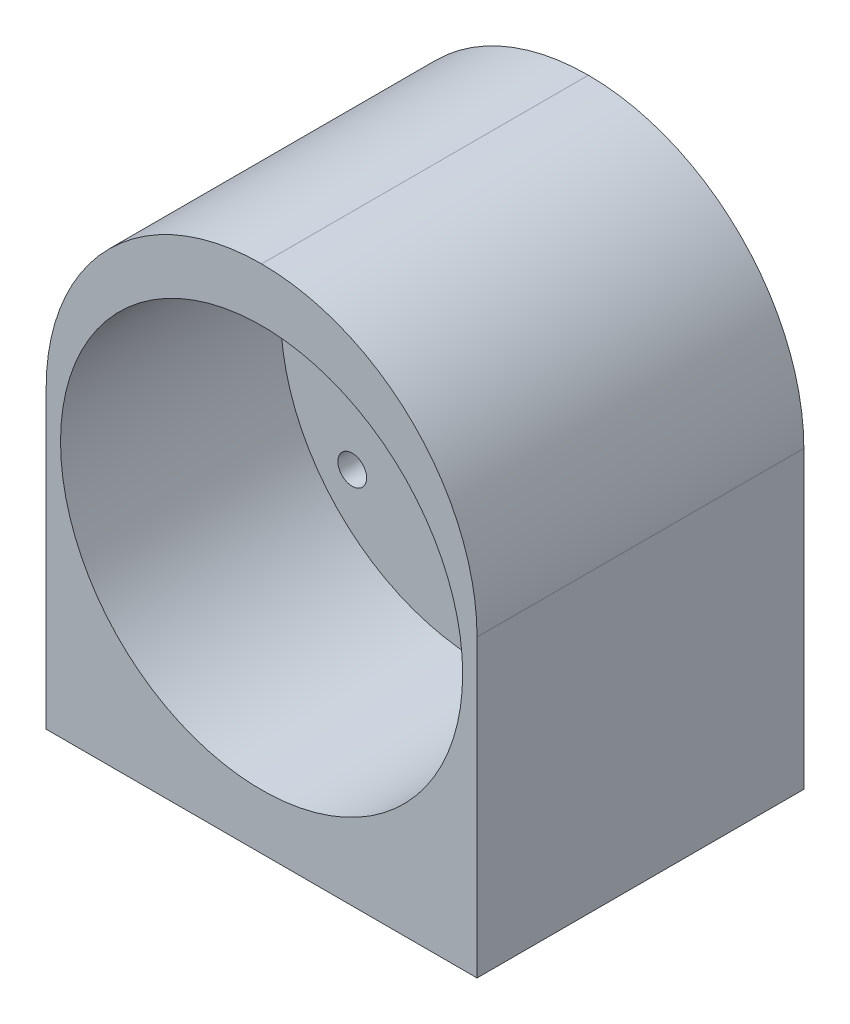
ISO-10303-21;
HEADER;
FILE_DESCRIPTION(('STEP AP214'),'2;1');
FILE_NAME('part.step','',(''),(''),'','','');
FILE_SCHEMA(('AUTOMOTIVE_DESIGN { 1 0 10303 214 1 1 1 1 }'));
ENDSEC;
DATA;
#1=APPLICATION_CONTEXT('core data for automotive mechanical design processes');
#2=APPLICATION_PROTOCOL_DEFINITION('international standard','automotive_design',2000,#1);
#3=PRODUCT_CONTEXT('',#1,'mechanical');
#4=PRODUCT('Part','Part','',(#3));
#5=PRODUCT_RELATED_PRODUCT_CATEGORY('part','',(#4));
#6=PRODUCT_DEFINITION_FORMATION('','',#4);
#7=PRODUCT_DEFINITION_CONTEXT('part definition',#1,'design');
#8=PRODUCT_DEFINITION('design','',#6,#7);
#9=PRODUCT_DEFINITION_SHAPE('','',#8);
#10=(LENGTH_UNIT() NAMED_UNIT(*) SI_UNIT(.MILLI.,.METRE.));
#11=(NAMED_UNIT(*) PLANE_ANGLE_UNIT() SI_UNIT($,.RADIAN.));
#12=(NAMED_UNIT(*) SI_UNIT($,.STERADIAN.) SOLID_ANGLE_UNIT());
#13=UNCERTAINTY_MEASURE_WITH_UNIT(LENGTH_MEASURE(1.E-05),#10,'distance_accuracy_value','');
#14=(GEOMETRIC_REPRESENTATION_CONTEXT(3) GLOBAL_UNCERTAINTY_ASSIGNED_CONTEXT((#13)) GLOBAL_UNIT_ASSIGNED_CONTEXT((#10,
#11,#12)) REPRESENTATION_CONTEXT('',''));
#15=CARTESIAN_POINT('',(0.,0.,0.));
#16=DIRECTION('',(0.,0.,1.));
#17=DIRECTION('',(1.,0.,0.));
#18=AXIS2_PLACEMENT_3D('',#15,#16,#17);
#19=CARTESIAN_POINT('',(-32.2359995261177,53.34,-12.1359057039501));
#20=DIRECTION('',(1.,0.,0.));
#21=DIRECTION('',(0.,0.,-1.));
#22=AXIS2_PLACEMENT_3D('',#19,#20,#21);
#23=PLANE('',#22);
#24=DIRECTION('',(0.,-1.,0.));
#25=VECTOR('',#24,1.);
#26=CARTESIAN_POINT('',(-32.2359995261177,53.34,21.9963290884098));
#27=LINE('',#26,#25);
#28=CARTESIAN_POINT('',(-32.2359995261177,30.84,21.9963290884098));
#29=VERTEX_POINT('',#28);
#30=CARTESIAN_POINT('',(-32.2359995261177,0.,21.9963290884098));
#31=VERTEX_POINT('',#30);
#32=EDGE_CURVE('E88',#29,#31,#27,.T.);
#33=ORIENTED_EDGE('',*,*,#32,.F.);
#34=DIRECTION('',(0.,0.,1.));
#35=VECTOR('',#34,1.);
#36=CARTESIAN_POINT('',(-32.2359995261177,30.84,-12.1359057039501));
#37=LINE('',#36,#35);
#38=CARTESIAN_POINT('',(-32.2359995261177,30.84,-12.1359057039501));
#39=VERTEX_POINT('',#38);
#40=EDGE_CURVE('E149',#29,#39,#37,.F.);
#41=ORIENTED_EDGE('',*,*,#40,.T.);
#42=DIRECTION('',(0.,-1.,0.));
#43=VECTOR('',#42,1.);
#44=CARTESIAN_POINT('',(-32.2359995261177,53.34,-12.1359057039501));
#45=LINE('',#44,#43);
#46=CARTESIAN_POINT('',(-32.2359995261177,0.,-12.1359057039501));
#47=VERTEX_POINT('',#46);
#48=EDGE_CURVE('E110',#39,#47,#45,.T.);
#49=ORIENTED_EDGE('',*,*,#48,.T.);
#50=DIRECTION('',(0.,0.,1.));
#51=VECTOR('',#50,1.);
#52=CARTESIAN_POINT('',(-32.2359995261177,0.,-12.1359057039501));
#53=LINE('',#52,#51);
#54=EDGE_CURVE('E105',#47,#31,#53,.T.);
#55=ORIENTED_EDGE('',*,*,#54,.T.);
#56=EDGE_LOOP('',(#33,#41,#49,#55));
#57=FACE_BOUND('',#56,.T.);
#58=ADVANCED_FACE('F36',(#57),#23,.F.);
#59=CARTESIAN_POINT('',(-32.2359995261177,53.34,21.9963290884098));
#60=DIRECTION('',(0.,0.,-1.));
#61=DIRECTION('',(-1.,0.,0.));
#62=AXIS2_PLACEMENT_3D('',#59,#60,#61);
#63=PLANE('',#62);
#64=CARTESIAN_POINT('',(-9.73400770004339,26.7535625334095,21.9963290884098));
#65=DIRECTION('',(0.,0.,-1.));
#66=DIRECTION('',(-1.,0.,0.));
#67=AXIS2_PLACEMENT_3D('',#64,#65,#66);
#68=CIRCLE('',#67,21.);
#69=CARTESIAN_POINT('',(-30.7340077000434,26.7535625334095,21.9963290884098));
#70=VERTEX_POINT('',#69);
#71=EDGE_CURVE('E112',#70,#70,#68,.T.);
#72=ORIENTED_EDGE('',*,*,#71,.T.);
#73=EDGE_LOOP('',(#72));
#74=FACE_BOUND('',#73,.T.);
#75=DIRECTION('',(0.,-1.,0.));
#76=VECTOR('',#75,1.);
#77=CARTESIAN_POINT('',(12.767984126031,53.34,21.9963290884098));
#78=LINE('',#77,#76);
#79=CARTESIAN_POINT('',(12.767984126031,30.84,21.9963290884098));
#80=VERTEX_POINT('',#79);
#81=CARTESIAN_POINT('',(12.767984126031,0.,21.9963290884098));
#82=VERTEX_POINT('',#81);
#83=EDGE_CURVE('E99',#80,#82,#78,.T.);
#84=ORIENTED_EDGE('',*,*,#83,.F.);
#85=CARTESIAN_POINT('',(-9.73201587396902,30.84,21.9963290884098));
#86=DIRECTION('',(0.,0.,-1.));
#87=DIRECTION('',(-1.,0.,0.));
#88=AXIS2_PLACEMENT_3D('',#85,#86,#87);
#89=CIRCLE('',#88,22.5);
#90=CARTESIAN_POINT('',(-9.73201587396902,53.34,21.9963290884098));
#91=VERTEX_POINT('',#90);
#92=EDGE_CURVE('E11',#80,#91,#89,.F.);
#93=ORIENTED_EDGE('',*,*,#92,.T.);
#94=DIRECTION('',(1.,0.,0.));
#95=VECTOR('',#94,1.);
#96=CARTESIAN_POINT('',(-32.2359995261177,53.34,21.9963290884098));
#97=LINE('',#96,#95);
#98=CARTESIAN_POINT('',(-9.73599952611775,53.34,21.9963290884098));
#99=VERTEX_POINT('',#98);
#100=EDGE_CURVE('E124',#99,#91,#97,.T.);
#101=ORIENTED_EDGE('',*,*,#100,.F.);
#102=CARTESIAN_POINT('',(-9.73599952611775,30.84,21.9963290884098));
#103=DIRECTION('',(0.,0.,-1.));
#104=DIRECTION('',(-1.,0.,0.));
#105=AXIS2_PLACEMENT_3D('',#102,#103,#104);
#106=CIRCLE('',#105,22.5);
#107=EDGE_CURVE('E94',#99,#29,#106,.F.);
#108=ORIENTED_EDGE('',*,*,#107,.T.);
#109=ORIENTED_EDGE('',*,*,#32,.T.);
#110=DIRECTION('',(1.,0.,0.));
#111=VECTOR('',#110,1.);
#112=CARTESIAN_POINT('',(-32.2359995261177,0.,21.9963290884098));
#113=LINE('',#112,#111);
#114=EDGE_CURVE('E91',#31,#82,#113,.T.);
#115=ORIENTED_EDGE('',*,*,#114,.T.);
#116=EDGE_LOOP('',(#84,#93,#101,#108,#109,#115));
#117=FACE_BOUND('',#116,.T.);
#118=ADVANCED_FACE('F90',(#74,#117),#63,.F.);
#119=CARTESIAN_POINT('',(12.767984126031,53.34,21.9963290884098));
#120=DIRECTION('',(-1.,0.,0.));
#121=DIRECTION('',(0.,0.,1.));
#122=AXIS2_PLACEMENT_3D('',#119,#120,#121);
#123=PLANE('',#122);
#124=DIRECTION('',(0.,-1.,0.));
#125=VECTOR('',#124,1.);
#126=CARTESIAN_POINT('',(12.767984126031,53.34,-12.1359057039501));
#127=LINE('',#126,#125);
#128=CARTESIAN_POINT('',(12.767984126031,30.84,-12.1359057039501));
#129=VERTEX_POINT('',#128);
#130=CARTESIAN_POINT('',(12.767984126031,0.,-12.1359057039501));
#131=VERTEX_POINT('',#130);
#132=EDGE_CURVE('E126',#129,#131,#127,.T.);
#133=ORIENTED_EDGE('',*,*,#132,.F.);
#134=DIRECTION('',(0.,0.,-1.));
#135=VECTOR('',#134,1.);
#136=CARTESIAN_POINT('',(12.767984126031,30.84,21.9963290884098));
#137=LINE('',#136,#135);
#138=EDGE_CURVE('E45',#129,#80,#137,.F.);
#139=ORIENTED_EDGE('',*,*,#138,.T.);
#140=ORIENTED_EDGE('',*,*,#83,.T.);
#141=DIRECTION('',(0.,0.,-1.));
#142=VECTOR('',#141,1.);
#143=CARTESIAN_POINT('',(12.767984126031,0.,21.9963290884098));
#144=LINE('',#143,#142);
#145=EDGE_CURVE('E107',#82,#131,#144,.T.);
#146=ORIENTED_EDGE('',*,*,#145,.T.);
#147=EDGE_LOOP('',(#133,#139,#140,#146));
#148=FACE_BOUND('',#147,.T.);
#149=ADVANCED_FACE('F233',(#148),#123,.F.);
#150=CARTESIAN_POINT('',(12.767984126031,53.34,-12.1359057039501));
#151=DIRECTION('',(0.,0.,1.));
#152=DIRECTION('',(1.,0.,0.));
#153=AXIS2_PLACEMENT_3D('',#150,#151,#152);
#154=PLANE('',#153);
#155=CARTESIAN_POINT('',(-9.73400770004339,26.7535625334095,-12.1359057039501));
#156=DIRECTION('',(0.,0.,1.));
#157=DIRECTION('',(1.,0.,0.));
#158=AXIS2_PLACEMENT_3D('',#155,#156,#157);
#159=CIRCLE('',#158,5.);
#160=CARTESIAN_POINT('',(-4.73400770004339,26.7535625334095,-12.1359057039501));
#161=VERTEX_POINT('',#160);
#162=EDGE_CURVE('E188',#161,#161,#159,.T.);
#163=ORIENTED_EDGE('',*,*,#162,.T.);
#164=EDGE_LOOP('',(#163));
#165=FACE_BOUND('',#164,.T.);
#166=CARTESIAN_POINT('',(-23.2634733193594,37.0451552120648,-12.1359057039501));
#167=DIRECTION('',(0.,0.,1.));
#168=DIRECTION('',(1.,0.,0.));
#169=AXIS2_PLACEMENT_3D('',#166,#167,#168);
#170=CIRCLE('',#169,1.5);
#171=CARTESIAN_POINT('',(-21.7634733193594,37.0451552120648,-12.1359057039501));
#172=VERTEX_POINT('',#171);
#173=EDGE_CURVE('E145',#172,#172,#170,.T.);
#174=ORIENTED_EDGE('',*,*,#173,.T.);
#175=EDGE_LOOP('',(#174));
#176=FACE_BOUND('',#175,.T.);
#177=CARTESIAN_POINT('',(-23.2634733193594,16.4619698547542,-12.1359057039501));
#178=DIRECTION('',(0.,0.,1.));
#179=DIRECTION('',(1.,0.,0.));
#180=AXIS2_PLACEMENT_3D('',#177,#178,#179);
#181=CIRCLE('',#180,1.5);
#182=CARTESIAN_POINT('',(-21.7634733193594,16.4619698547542,-12.1359057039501));
#183=VERTEX_POINT('',#182);
#184=EDGE_CURVE('E141',#183,#183,#181,.T.);
#185=ORIENTED_EDGE('',*,*,#184,.T.);
#186=EDGE_LOOP('',(#185));
#187=FACE_BOUND('',#186,.T.);
#188=CARTESIAN_POINT('',(3.7954579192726,16.4619698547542,-12.1359057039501));
#189=DIRECTION('',(0.,0.,1.));
#190=DIRECTION('',(1.,0.,0.));
#191=AXIS2_PLACEMENT_3D('',#188,#189,#190);
#192=CIRCLE('',#191,1.5);
#193=CARTESIAN_POINT('',(5.2954579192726,16.4619698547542,-12.1359057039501));
#194=VERTEX_POINT('',#193);
#195=EDGE_CURVE('E137',#194,#194,#192,.T.);
#196=ORIENTED_EDGE('',*,*,#195,.T.);
#197=EDGE_LOOP('',(#196));
#198=FACE_BOUND('',#197,.T.);
#199=CARTESIAN_POINT('',(3.7954579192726,37.0451552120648,-12.1359057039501));
#200=DIRECTION('',(0.,0.,1.));
#201=DIRECTION('',(1.,0.,0.));
#202=AXIS2_PLACEMENT_3D('',#199,#200,#201);
#203=CIRCLE('',#202,1.5);
#204=CARTESIAN_POINT('',(5.2954579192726,37.0451552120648,-12.1359057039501));
#205=VERTEX_POINT('',#204);
#206=EDGE_CURVE('E132',#205,#205,#203,.T.);
#207=ORIENTED_EDGE('',*,*,#206,.T.);
#208=EDGE_LOOP('',(#207));
#209=FACE_BOUND('',#208,.T.);
#210=DIRECTION('',(-1.,0.,0.));
#211=VECTOR('',#210,1.);
#212=CARTESIAN_POINT('',(12.767984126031,53.34,-12.1359057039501));
#213=LINE('',#212,#211);
#214=CARTESIAN_POINT('',(-9.73201587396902,53.34,-12.1359057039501));
#215=VERTEX_POINT('',#214);
#216=CARTESIAN_POINT('',(-9.73599952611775,53.34,-12.1359057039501));
#217=VERTEX_POINT('',#216);
#218=EDGE_CURVE('E118',#215,#217,#213,.T.);
#219=ORIENTED_EDGE('',*,*,#218,.F.);
#220=CARTESIAN_POINT('',(-9.73201587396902,30.84,-12.1359057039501));
#221=DIRECTION('',(0.,0.,1.));
#222=DIRECTION('',(1.,0.,0.));
#223=AXIS2_PLACEMENT_3D('',#220,#221,#222);
#224=CIRCLE('',#223,22.5);
#225=EDGE_CURVE('E59',#215,#129,#224,.F.);
#226=ORIENTED_EDGE('',*,*,#225,.T.);
#227=ORIENTED_EDGE('',*,*,#132,.T.);
#228=DIRECTION('',(-1.,0.,0.));
#229=VECTOR('',#228,1.);
#230=CARTESIAN_POINT('',(12.767984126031,0.,-12.1359057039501));
#231=LINE('',#230,#229);
#232=EDGE_CURVE('E122',#131,#47,#231,.T.);
#233=ORIENTED_EDGE('',*,*,#232,.T.);
#234=ORIENTED_EDGE('',*,*,#48,.F.);
#235=CARTESIAN_POINT('',(-9.73599952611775,30.84,-12.1359057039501));
#236=DIRECTION('',(0.,0.,1.));
#237=DIRECTION('',(1.,0.,0.));
#238=AXIS2_PLACEMENT_3D('',#235,#236,#237);
#239=CIRCLE('',#238,22.5);
#240=EDGE_CURVE('E151',#39,#217,#239,.F.);
#241=ORIENTED_EDGE('',*,*,#240,.T.);
#242=EDGE_LOOP('',(#219,#226,#227,#233,#234,#241));
#243=FACE_BOUND('',#242,.T.);
#244=ADVANCED_FACE('F164',(#165,#176,#187,#198,#209,#243),#154,.F.);
#245=CARTESIAN_POINT('',(0.,53.34,0.));
#246=DIRECTION('',(0.,1.,0.));
#247=DIRECTION('',(0.,0.,1.));
#248=AXIS2_PLACEMENT_3D('',#245,#246,#247);
#249=PLANE('',#248);
#250=ORIENTED_EDGE('',*,*,#100,.T.);
#251=DIRECTION('',(0.,0.,-1.));
#252=VECTOR('',#251,1.);
#253=CARTESIAN_POINT('',(-9.73201587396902,53.34,-12.1359057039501));
#254=LINE('',#253,#252);
#255=EDGE_CURVE('E154',#91,#215,#254,.T.);
#256=ORIENTED_EDGE('',*,*,#255,.T.);
#257=ORIENTED_EDGE('',*,*,#218,.T.);
#258=DIRECTION('',(0.,0.,1.));
#259=VECTOR('',#258,1.);
#260=CARTESIAN_POINT('',(-9.73599952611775,53.34,21.9963290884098));
#261=LINE('',#260,#259);
#262=EDGE_CURVE('E98',#217,#99,#261,.T.);
#263=ORIENTED_EDGE('',*,*,#262,.T.);
#264=EDGE_LOOP('',(#250,#256,#257,#263));
#265=FACE_BOUND('',#264,.T.);
#266=ADVANCED_FACE('F161',(#265),#249,.T.);
#267=CARTESIAN_POINT('',(0.,0.,0.));
#268=DIRECTION('',(0.,1.,0.));
#269=DIRECTION('',(0.,0.,1.));
#270=AXIS2_PLACEMENT_3D('',#267,#268,#269);
#271=PLANE('',#270);
#272=CARTESIAN_POINT('',(5.76742331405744,0.,12.9826025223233));
#273=DIRECTION('',(0.,-1.,0.));
#274=DIRECTION('',(0.,0.,-1.));
#275=AXIS2_PLACEMENT_3D('',#272,#273,#274);
#276=CIRCLE('',#275,1.5);
#277=CARTESIAN_POINT('',(5.76742331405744,0.,11.4826025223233));
#278=VERTEX_POINT('',#277);
#279=EDGE_CURVE('E184',#278,#278,#276,.T.);
#280=ORIENTED_EDGE('',*,*,#279,.F.);
#281=EDGE_LOOP('',(#280));
#282=FACE_BOUND('',#281,.T.);
#283=CARTESIAN_POINT('',(5.76742331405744,0.,-3.14083948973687));
#284=DIRECTION('',(0.,-1.,0.));
#285=DIRECTION('',(0.,0.,-1.));
#286=AXIS2_PLACEMENT_3D('',#283,#284,#285);
#287=CIRCLE('',#286,1.5);
#288=CARTESIAN_POINT('',(5.76742331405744,0.,-4.64083948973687));
#289=VERTEX_POINT('',#288);
#290=EDGE_CURVE('E191',#289,#289,#287,.T.);
#291=ORIENTED_EDGE('',*,*,#290,.F.);
#292=EDGE_LOOP('',(#291));
#293=FACE_BOUND('',#292,.T.);
#294=CARTESIAN_POINT('',(-25.233771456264,0.,-3.14083948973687));
#295=DIRECTION('',(0.,-1.,0.));
#296=DIRECTION('',(0.,0.,-1.));
#297=AXIS2_PLACEMENT_3D('',#294,#295,#296);
#298=CIRCLE('',#297,1.5);
#299=CARTESIAN_POINT('',(-25.233771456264,0.,-4.64083948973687));
#300=VERTEX_POINT('',#299);
#301=EDGE_CURVE('E197',#300,#300,#298,.T.);
#302=ORIENTED_EDGE('',*,*,#301,.F.);
#303=EDGE_LOOP('',(#302));
#304=FACE_BOUND('',#303,.T.);
#305=CARTESIAN_POINT('',(-25.233771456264,0.,12.9826025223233));
#306=DIRECTION('',(0.,-1.,0.));
#307=DIRECTION('',(0.,0.,-1.));
#308=AXIS2_PLACEMENT_3D('',#305,#306,#307);
#309=CIRCLE('',#308,1.5);
#310=CARTESIAN_POINT('',(-25.233771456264,0.,11.4826025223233));
#311=VERTEX_POINT('',#310);
#312=EDGE_CURVE('E178',#311,#311,#309,.T.);
#313=ORIENTED_EDGE('',*,*,#312,.F.);
#314=EDGE_LOOP('',(#313));
#315=FACE_BOUND('',#314,.T.);
#316=ORIENTED_EDGE('',*,*,#54,.F.);
#317=ORIENTED_EDGE('',*,*,#232,.F.);
#318=ORIENTED_EDGE('',*,*,#145,.F.);
#319=ORIENTED_EDGE('',*,*,#114,.F.);
#320=EDGE_LOOP('',(#316,#317,#318,#319));
#321=FACE_BOUND('',#320,.T.);
#322=ADVANCED_FACE('F103',(#282,#293,#304,#315,#321),#271,.F.);
#323=CARTESIAN_POINT('',(-9.73400770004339,26.7535625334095,-0.999999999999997));
#324=DIRECTION('',(0.,0.,1.));
#325=DIRECTION('',(1.,0.,0.));
#326=AXIS2_PLACEMENT_3D('',#323,#324,#325);
#327=CYLINDRICAL_SURFACE('',#326,21.);
#328=CARTESIAN_POINT('',(-9.73400770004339,26.7535625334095,-0.999999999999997));
#329=DIRECTION('',(0.,0.,1.));
#330=DIRECTION('',(1.,0.,0.));
#331=AXIS2_PLACEMENT_3D('',#328,#329,#330);
#332=CIRCLE('',#331,21.);
#333=CARTESIAN_POINT('',(11.2659922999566,26.7535625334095,-0.999999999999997));
#334=VERTEX_POINT('',#333);
#335=EDGE_CURVE('E115',#334,#334,#332,.T.);
#336=ORIENTED_EDGE('',*,*,#335,.F.);
#337=EDGE_LOOP('',(#336));
#338=FACE_BOUND('',#337,.T.);
#339=ORIENTED_EDGE('',*,*,#71,.F.);
#340=EDGE_LOOP('',(#339));
#341=FACE_BOUND('',#340,.T.);
#342=ADVANCED_FACE('F215',(#338,#341),#327,.F.);
#343=CARTESIAN_POINT('',(-9.73400770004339,26.7535625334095,-0.999999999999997));
#344=DIRECTION('',(0.,0.,1.));
#345=DIRECTION('',(1.,0.,0.));
#346=AXIS2_PLACEMENT_3D('',#343,#344,#345);
#347=PLANE('',#346);
#348=CARTESIAN_POINT('',(-9.73400770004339,26.7535625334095,-0.999999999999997));
#349=DIRECTION('',(0.,0.,1.));
#350=DIRECTION('',(1.,0.,0.));
#351=AXIS2_PLACEMENT_3D('',#348,#349,#350);
#352=CIRCLE('',#351,5.);
#353=CARTESIAN_POINT('',(-4.73400770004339,26.7535625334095,-0.999999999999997));
#354=VERTEX_POINT('',#353);
#355=EDGE_CURVE('E40',#354,#354,#352,.T.);
#356=ORIENTED_EDGE('',*,*,#355,.F.);
#357=EDGE_LOOP('',(#356));
#358=FACE_BOUND('',#357,.T.);
#359=CARTESIAN_POINT('',(-23.2634733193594,37.0451552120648,-0.999999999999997));
#360=DIRECTION('',(0.,0.,1.));
#361=DIRECTION('',(1.,0.,0.));
#362=AXIS2_PLACEMENT_3D('',#359,#360,#361);
#363=CIRCLE('',#362,1.5);
#364=CARTESIAN_POINT('',(-21.7634733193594,37.0451552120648,-0.999999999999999));
#365=VERTEX_POINT('',#364);
#366=EDGE_CURVE('E142',#365,#365,#363,.T.);
#367=ORIENTED_EDGE('',*,*,#366,.F.);
#368=EDGE_LOOP('',(#367));
#369=FACE_BOUND('',#368,.T.);
#370=CARTESIAN_POINT('',(-23.2634733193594,16.4619698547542,-0.999999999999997));
#371=DIRECTION('',(0.,0.,1.));
#372=DIRECTION('',(1.,0.,0.));
#373=AXIS2_PLACEMENT_3D('',#370,#371,#372);
#374=CIRCLE('',#373,1.5);
#375=CARTESIAN_POINT('',(-21.7634733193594,16.4619698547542,-0.999999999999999));
#376=VERTEX_POINT('',#375);
#377=EDGE_CURVE('E138',#376,#376,#374,.T.);
#378=ORIENTED_EDGE('',*,*,#377,.F.);
#379=EDGE_LOOP('',(#378));
#380=FACE_BOUND('',#379,.T.);
#381=CARTESIAN_POINT('',(3.7954579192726,16.4619698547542,-0.999999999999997));
#382=DIRECTION('',(0.,0.,1.));
#383=DIRECTION('',(1.,0.,0.));
#384=AXIS2_PLACEMENT_3D('',#381,#382,#383);
#385=CIRCLE('',#384,1.5);
#386=CARTESIAN_POINT('',(5.2954579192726,16.4619698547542,-0.999999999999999));
#387=VERTEX_POINT('',#386);
#388=EDGE_CURVE('E134',#387,#387,#385,.T.);
#389=ORIENTED_EDGE('',*,*,#388,.F.);
#390=EDGE_LOOP('',(#389));
#391=FACE_BOUND('',#390,.T.);
#392=CARTESIAN_POINT('',(3.7954579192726,37.0451552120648,-0.999999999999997));
#393=DIRECTION('',(0.,0.,1.));
#394=DIRECTION('',(1.,0.,0.));
#395=AXIS2_PLACEMENT_3D('',#392,#393,#394);
#396=CIRCLE('',#395,1.5);
#397=CARTESIAN_POINT('',(5.2954579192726,37.0451552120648,-0.999999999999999));
#398=VERTEX_POINT('',#397);
#399=EDGE_CURVE('E129',#398,#398,#396,.T.);
#400=ORIENTED_EDGE('',*,*,#399,.F.);
#401=EDGE_LOOP('',(#400));
#402=FACE_BOUND('',#401,.T.);
#403=ORIENTED_EDGE('',*,*,#335,.T.);
#404=EDGE_LOOP('',(#403));
#405=FACE_BOUND('',#404,.T.);
#406=ADVANCED_FACE('F211',(#358,#369,#380,#391,#402,#405),#347,.T.);
#407=CARTESIAN_POINT('',(3.7954579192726,37.0451552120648,-13.));
#408=DIRECTION('',(0.,0.,1.));
#409=DIRECTION('',(1.,0.,0.));
#410=AXIS2_PLACEMENT_3D('',#407,#408,#409);
#411=CYLINDRICAL_SURFACE('',#410,1.5);
#412=CARTESIAN_POINT('',(5.2954579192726,37.0451552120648,-0.999999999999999));
#413=CARTESIAN_POINT('',(5.2954579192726,37.0451552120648,-1.11599901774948));
#414=CARTESIAN_POINT('',(5.2954579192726,37.0451552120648,-1.23199803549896));
#415=CARTESIAN_POINT('',(5.2954579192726,37.0451552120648,-1.46399607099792));
#416=CARTESIAN_POINT('',(5.2954579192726,37.0451552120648,-1.5799950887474));
#417=CARTESIAN_POINT('',(5.2954579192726,37.0451552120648,-1.81199312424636));
#418=CARTESIAN_POINT('',(5.2954579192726,37.0451552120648,-1.92799214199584));
#419=CARTESIAN_POINT('',(5.2954579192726,37.0451552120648,-2.15999017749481));
#420=CARTESIAN_POINT('',(5.2954579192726,37.0451552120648,-2.27598919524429));
#421=CARTESIAN_POINT('',(5.2954579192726,37.0451552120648,-2.50798723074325));
#422=CARTESIAN_POINT('',(5.2954579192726,37.0451552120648,-2.62398624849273));
#423=CARTESIAN_POINT('',(5.2954579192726,37.0451552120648,-2.85598428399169));
#424=CARTESIAN_POINT('',(5.2954579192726,37.0451552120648,-2.97198330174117));
#425=CARTESIAN_POINT('',(5.2954579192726,37.0451552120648,-3.20398133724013));
#426=CARTESIAN_POINT('',(5.2954579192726,37.0451552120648,-3.31998035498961));
#427=CARTESIAN_POINT('',(5.2954579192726,37.0451552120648,-3.55197839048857));
#428=CARTESIAN_POINT('',(5.2954579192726,37.0451552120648,-3.66797740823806));
#429=CARTESIAN_POINT('',(5.2954579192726,37.0451552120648,-3.89997544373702));
#430=CARTESIAN_POINT('',(5.2954579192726,37.0451552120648,-4.0159744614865));
#431=CARTESIAN_POINT('',(5.2954579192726,37.0451552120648,-4.24797249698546));
#432=CARTESIAN_POINT('',(5.2954579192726,37.0451552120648,-4.36397151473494));
#433=CARTESIAN_POINT('',(5.2954579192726,37.0451552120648,-4.5959695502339));
#434=CARTESIAN_POINT('',(5.2954579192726,37.0451552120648,-4.71196856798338));
#435=CARTESIAN_POINT('',(5.2954579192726,37.0451552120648,-4.94396660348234));
#436=CARTESIAN_POINT('',(5.2954579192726,37.0451552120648,-5.05996562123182));
#437=CARTESIAN_POINT('',(5.2954579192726,37.0451552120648,-5.29196365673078));
#438=CARTESIAN_POINT('',(5.2954579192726,37.0451552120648,-5.40796267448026));
#439=CARTESIAN_POINT('',(5.2954579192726,37.0451552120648,-5.63996070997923));
#440=CARTESIAN_POINT('',(5.2954579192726,37.0451552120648,-5.75595972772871));
#441=CARTESIAN_POINT('',(5.2954579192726,37.0451552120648,-5.98795776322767));
#442=CARTESIAN_POINT('',(5.2954579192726,37.0451552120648,-6.10395678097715));
#443=CARTESIAN_POINT('',(5.2954579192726,37.0451552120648,-6.33595481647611));
#444=CARTESIAN_POINT('',(5.2954579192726,37.0451552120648,-6.45195383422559));
#445=CARTESIAN_POINT('',(5.2954579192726,37.0451552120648,-6.68395186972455));
#446=CARTESIAN_POINT('',(5.2954579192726,37.0451552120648,-6.79995088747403));
#447=CARTESIAN_POINT('',(5.2954579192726,37.0451552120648,-7.03194892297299));
#448=CARTESIAN_POINT('',(5.2954579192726,37.0451552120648,-7.14794794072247));
#449=CARTESIAN_POINT('',(5.2954579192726,37.0451552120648,-7.37994597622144));
#450=CARTESIAN_POINT('',(5.2954579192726,37.0451552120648,-7.49594499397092));
#451=CARTESIAN_POINT('',(5.2954579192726,37.0451552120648,-7.72794302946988));
#452=CARTESIAN_POINT('',(5.2954579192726,37.0451552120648,-7.84394204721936));
#453=CARTESIAN_POINT('',(5.2954579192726,37.0451552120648,-8.07594008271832));
#454=CARTESIAN_POINT('',(5.2954579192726,37.0451552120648,-8.1919391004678));
#455=CARTESIAN_POINT('',(5.2954579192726,37.0451552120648,-8.42393713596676));
#456=CARTESIAN_POINT('',(5.2954579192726,37.0451552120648,-8.53993615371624));
#457=CARTESIAN_POINT('',(5.2954579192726,37.0451552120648,-8.77193418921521));
#458=CARTESIAN_POINT('',(5.2954579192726,37.0451552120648,-8.88793320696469));
#459=CARTESIAN_POINT('',(5.2954579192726,37.0451552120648,-9.11993124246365));
#460=CARTESIAN_POINT('',(5.2954579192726,37.0451552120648,-9.23593026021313));
#461=CARTESIAN_POINT('',(5.2954579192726,37.0451552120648,-9.46792829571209));
#462=CARTESIAN_POINT('',(5.2954579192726,37.0451552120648,-9.58392731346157));
#463=CARTESIAN_POINT('',(5.2954579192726,37.0451552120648,-9.81592534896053));
#464=CARTESIAN_POINT('',(5.2954579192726,37.0451552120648,-9.93192436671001));
#465=CARTESIAN_POINT('',(5.2954579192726,37.0451552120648,-10.163922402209));
#466=CARTESIAN_POINT('',(5.2954579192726,37.0451552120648,-10.2799214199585));
#467=CARTESIAN_POINT('',(5.2954579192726,37.0451552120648,-10.5119194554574));
#468=CARTESIAN_POINT('',(5.2954579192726,37.0451552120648,-10.6279184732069));
#469=CARTESIAN_POINT('',(5.2954579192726,37.0451552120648,-10.8599165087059));
#470=CARTESIAN_POINT('',(5.2954579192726,37.0451552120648,-10.9759155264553));
#471=CARTESIAN_POINT('',(5.2954579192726,37.0451552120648,-11.2079135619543));
#472=CARTESIAN_POINT('',(5.2954579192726,37.0451552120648,-11.3239125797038));
#473=CARTESIAN_POINT('',(5.2954579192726,37.0451552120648,-11.5559106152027));
#474=CARTESIAN_POINT('',(5.2954579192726,37.0451552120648,-11.6719096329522));
#475=CARTESIAN_POINT('',(5.2954579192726,37.0451552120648,-11.9039076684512));
#476=CARTESIAN_POINT('',(5.2954579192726,37.0451552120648,-12.0199066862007));
#477=CARTESIAN_POINT('',(5.2954579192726,37.0451552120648,-12.1359057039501));
#478=B_SPLINE_CURVE_WITH_KNOTS('',3,(#412,#413,#414,#415,#416,#417,#418,#419,#420,#421,#422,
#423,#424,#425,#426,#427,#428,#429,#430,#431,#432,#433,#434,#435,#436,#437,#438,#439,#440,#441,
#442,#443,#444,#445,#446,#447,#448,#449,#450,#451,#452,#453,#454,#455,#456,#457,#458,#459,#460,
#461,#462,#463,#464,#465,#466,#467,#468,#469,#470,#471,#472,#473,#474,#475,#476,#477),
.UNSPECIFIED.,.F.,.F.,(4,2,2,2,2,2,2,2,2,2,2,2,2,2,2,2,2,2,2,2,2,2,2,2,2,2,2,2,2,2,2,2,4),(0.,
0.347997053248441,0.695994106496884,1.04399115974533,1.39198821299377,1.73998526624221,
2.08798231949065,2.43597937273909,2.78397642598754,3.13197347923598,3.47997053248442,
3.82796758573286,4.1759646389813,4.52396169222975,4.87195874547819,5.21995579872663,
5.56795285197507,5.91594990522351,6.26394695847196,6.6119440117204,6.95994106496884,
7.30793811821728,7.65593517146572,8.00393222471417,8.35192927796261,8.69992633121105,
9.04792338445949,9.39592043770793,9.74391749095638,10.0919145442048,10.4399115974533,
10.7879086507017,11.1359057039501),.UNSPECIFIED.);
#479=EDGE_CURVE('BSEAM214',#398,#205,#478,.T.);
#480=ORIENTED_EDGE('',*,*,#399,.T.);
#481=ORIENTED_EDGE('',*,*,#206,.F.);
#482=ORIENTED_EDGE('',*,*,#479,.T.);
#483=ORIENTED_EDGE('',*,*,#479,.F.);
#484=EDGE_LOOP('',(#480,#482,#481,#483));
#485=FACE_BOUND('',#484,.T.);
#486=ADVANCED_FACE('F214',(#485),#411,.F.);
#487=CARTESIAN_POINT('',(3.7954579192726,16.4619698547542,-13.));
#488=DIRECTION('',(0.,0.,1.));
#489=DIRECTION('',(1.,0.,0.));
#490=AXIS2_PLACEMENT_3D('',#487,#488,#489);
#491=CYLINDRICAL_SURFACE('',#490,1.5);
#492=CARTESIAN_POINT('',(5.2954579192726,16.4619698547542,-0.999999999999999));
#493=CARTESIAN_POINT('',(5.2954579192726,16.4619698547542,-1.11599901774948));
#494=CARTESIAN_POINT('',(5.2954579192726,16.4619698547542,-1.23199803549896));
#495=CARTESIAN_POINT('',(5.2954579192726,16.4619698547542,-1.46399607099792));
#496=CARTESIAN_POINT('',(5.2954579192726,16.4619698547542,-1.5799950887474));
#497=CARTESIAN_POINT('',(5.2954579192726,16.4619698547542,-1.81199312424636));
#498=CARTESIAN_POINT('',(5.2954579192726,16.4619698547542,-1.92799214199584));
#499=CARTESIAN_POINT('',(5.2954579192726,16.4619698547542,-2.15999017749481));
#500=CARTESIAN_POINT('',(5.2954579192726,16.4619698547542,-2.27598919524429));
#501=CARTESIAN_POINT('',(5.2954579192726,16.4619698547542,-2.50798723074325));
#502=CARTESIAN_POINT('',(5.2954579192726,16.4619698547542,-2.62398624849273));
#503=CARTESIAN_POINT('',(5.2954579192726,16.4619698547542,-2.85598428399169));
#504=CARTESIAN_POINT('',(5.2954579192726,16.4619698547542,-2.97198330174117));
#505=CARTESIAN_POINT('',(5.2954579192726,16.4619698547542,-3.20398133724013));
#506=CARTESIAN_POINT('',(5.2954579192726,16.4619698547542,-3.31998035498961));
#507=CARTESIAN_POINT('',(5.2954579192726,16.4619698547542,-3.55197839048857));
#508=CARTESIAN_POINT('',(5.2954579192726,16.4619698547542,-3.66797740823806));
#509=CARTESIAN_POINT('',(5.2954579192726,16.4619698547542,-3.89997544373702));
#510=CARTESIAN_POINT('',(5.2954579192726,16.4619698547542,-4.0159744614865));
#511=CARTESIAN_POINT('',(5.2954579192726,16.4619698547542,-4.24797249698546));
#512=CARTESIAN_POINT('',(5.2954579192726,16.4619698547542,-4.36397151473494));
#513=CARTESIAN_POINT('',(5.2954579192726,16.4619698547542,-4.5959695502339));
#514=CARTESIAN_POINT('',(5.2954579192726,16.4619698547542,-4.71196856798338));
#515=CARTESIAN_POINT('',(5.2954579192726,16.4619698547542,-4.94396660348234));
#516=CARTESIAN_POINT('',(5.2954579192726,16.4619698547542,-5.05996562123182));
#517=CARTESIAN_POINT('',(5.2954579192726,16.4619698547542,-5.29196365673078));
#518=CARTESIAN_POINT('',(5.2954579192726,16.4619698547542,-5.40796267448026));
#519=CARTESIAN_POINT('',(5.2954579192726,16.4619698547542,-5.63996070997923));
#520=CARTESIAN_POINT('',(5.2954579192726,16.4619698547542,-5.75595972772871));
#521=CARTESIAN_POINT('',(5.2954579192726,16.4619698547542,-5.98795776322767));
#522=CARTESIAN_POINT('',(5.2954579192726,16.4619698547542,-6.10395678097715));
#523=CARTESIAN_POINT('',(5.2954579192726,16.4619698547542,-6.33595481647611));
#524=CARTESIAN_POINT('',(5.2954579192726,16.4619698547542,-6.45195383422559));
#525=CARTESIAN_POINT('',(5.2954579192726,16.4619698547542,-6.68395186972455));
#526=CARTESIAN_POINT('',(5.2954579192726,16.4619698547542,-6.79995088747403));
#527=CARTESIAN_POINT('',(5.2954579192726,16.4619698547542,-7.03194892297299));
#528=CARTESIAN_POINT('',(5.2954579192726,16.4619698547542,-7.14794794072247));
#529=CARTESIAN_POINT('',(5.2954579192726,16.4619698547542,-7.37994597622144));
#530=CARTESIAN_POINT('',(5.2954579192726,16.4619698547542,-7.49594499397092));
#531=CARTESIAN_POINT('',(5.2954579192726,16.4619698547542,-7.72794302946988));
#532=CARTESIAN_POINT('',(5.2954579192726,16.4619698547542,-7.84394204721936));
#533=CARTESIAN_POINT('',(5.2954579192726,16.4619698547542,-8.07594008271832));
#534=CARTESIAN_POINT('',(5.2954579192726,16.4619698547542,-8.1919391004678));
#535=CARTESIAN_POINT('',(5.2954579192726,16.4619698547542,-8.42393713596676));
#536=CARTESIAN_POINT('',(5.2954579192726,16.4619698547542,-8.53993615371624));
#537=CARTESIAN_POINT('',(5.2954579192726,16.4619698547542,-8.77193418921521));
#538=CARTESIAN_POINT('',(5.2954579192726,16.4619698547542,-8.88793320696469));
#539=CARTESIAN_POINT('',(5.2954579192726,16.4619698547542,-9.11993124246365));
#540=CARTESIAN_POINT('',(5.2954579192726,16.4619698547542,-9.23593026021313));
#541=CARTESIAN_POINT('',(5.2954579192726,16.4619698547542,-9.46792829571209));
#542=CARTESIAN_POINT('',(5.2954579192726,16.4619698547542,-9.58392731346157));
#543=CARTESIAN_POINT('',(5.2954579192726,16.4619698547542,-9.81592534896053));
#544=CARTESIAN_POINT('',(5.2954579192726,16.4619698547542,-9.93192436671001));
#545=CARTESIAN_POINT('',(5.2954579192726,16.4619698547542,-10.163922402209));
#546=CARTESIAN_POINT('',(5.2954579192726,16.4619698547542,-10.2799214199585));
#547=CARTESIAN_POINT('',(5.2954579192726,16.4619698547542,-10.5119194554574));
#548=CARTESIAN_POINT('',(5.2954579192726,16.4619698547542,-10.6279184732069));
#549=CARTESIAN_POINT('',(5.2954579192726,16.4619698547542,-10.8599165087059));
#550=CARTESIAN_POINT('',(5.2954579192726,16.4619698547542,-10.9759155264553));
#551=CARTESIAN_POINT('',(5.2954579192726,16.4619698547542,-11.2079135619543));
#552=CARTESIAN_POINT('',(5.2954579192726,16.4619698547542,-11.3239125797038));
#553=CARTESIAN_POINT('',(5.2954579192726,16.4619698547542,-11.5559106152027));
#554=CARTESIAN_POINT('',(5.2954579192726,16.4619698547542,-11.6719096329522));
#555=CARTESIAN_POINT('',(5.2954579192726,16.4619698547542,-11.9039076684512));
#556=CARTESIAN_POINT('',(5.2954579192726,16.4619698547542,-12.0199066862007));
#557=CARTESIAN_POINT('',(5.2954579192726,16.4619698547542,-12.1359057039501));
#558=B_SPLINE_CURVE_WITH_KNOTS('',3,(#492,#493,#494,#495,#496,#497,#498,#499,#500,#501,#502,
#503,#504,#505,#506,#507,#508,#509,#510,#511,#512,#513,#514,#515,#516,#517,#518,#519,#520,#521,
#522,#523,#524,#525,#526,#527,#528,#529,#530,#531,#532,#533,#534,#535,#536,#537,#538,#539,#540,
#541,#542,#543,#544,#545,#546,#547,#548,#549,#550,#551,#552,#553,#554,#555,#556,#557),
.UNSPECIFIED.,.F.,.F.,(4,2,2,2,2,2,2,2,2,2,2,2,2,2,2,2,2,2,2,2,2,2,2,2,2,2,2,2,2,2,2,2,4),(0.,
0.347997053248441,0.695994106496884,1.04399115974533,1.39198821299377,1.73998526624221,
2.08798231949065,2.43597937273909,2.78397642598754,3.13197347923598,3.47997053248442,
3.82796758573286,4.1759646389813,4.52396169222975,4.87195874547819,5.21995579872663,
5.56795285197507,5.91594990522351,6.26394695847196,6.6119440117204,6.95994106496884,
7.30793811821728,7.65593517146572,8.00393222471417,8.35192927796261,8.69992633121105,
9.04792338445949,9.39592043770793,9.74391749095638,10.0919145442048,10.4399115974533,
10.7879086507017,11.1359057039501),.UNSPECIFIED.);
#559=EDGE_CURVE('BSEAM257',#387,#194,#558,.T.);
#560=ORIENTED_EDGE('',*,*,#388,.T.);
#561=ORIENTED_EDGE('',*,*,#195,.F.);
#562=ORIENTED_EDGE('',*,*,#559,.T.);
#563=ORIENTED_EDGE('',*,*,#559,.F.);
#564=EDGE_LOOP('',(#560,#562,#561,#563));
#565=FACE_BOUND('',#564,.T.);
#566=ADVANCED_FACE('F257',(#565),#491,.F.);
#567=CARTESIAN_POINT('',(-23.2634733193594,16.4619698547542,-13.));
#568=DIRECTION('',(0.,0.,1.));
#569=DIRECTION('',(1.,0.,0.));
#570=AXIS2_PLACEMENT_3D('',#567,#568,#569);
#571=CYLINDRICAL_SURFACE('',#570,1.5);
#572=CARTESIAN_POINT('',(-21.7634733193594,16.4619698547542,-0.999999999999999));
#573=CARTESIAN_POINT('',(-21.7634733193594,16.4619698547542,-1.11599901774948));
#574=CARTESIAN_POINT('',(-21.7634733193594,16.4619698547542,-1.23199803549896));
#575=CARTESIAN_POINT('',(-21.7634733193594,16.4619698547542,-1.46399607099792));
#576=CARTESIAN_POINT('',(-21.7634733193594,16.4619698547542,-1.5799950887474));
#577=CARTESIAN_POINT('',(-21.7634733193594,16.4619698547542,-1.81199312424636));
#578=CARTESIAN_POINT('',(-21.7634733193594,16.4619698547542,-1.92799214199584));
#579=CARTESIAN_POINT('',(-21.7634733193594,16.4619698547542,-2.15999017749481));
#580=CARTESIAN_POINT('',(-21.7634733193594,16.4619698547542,-2.27598919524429));
#581=CARTESIAN_POINT('',(-21.7634733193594,16.4619698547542,-2.50798723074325));
#582=CARTESIAN_POINT('',(-21.7634733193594,16.4619698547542,-2.62398624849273));
#583=CARTESIAN_POINT('',(-21.7634733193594,16.4619698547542,-2.85598428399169));
#584=CARTESIAN_POINT('',(-21.7634733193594,16.4619698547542,-2.97198330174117));
#585=CARTESIAN_POINT('',(-21.7634733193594,16.4619698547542,-3.20398133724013));
#586=CARTESIAN_POINT('',(-21.7634733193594,16.4619698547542,-3.31998035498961));
#587=CARTESIAN_POINT('',(-21.7634733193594,16.4619698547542,-3.55197839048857));
#588=CARTESIAN_POINT('',(-21.7634733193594,16.4619698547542,-3.66797740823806));
#589=CARTESIAN_POINT('',(-21.7634733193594,16.4619698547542,-3.89997544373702));
#590=CARTESIAN_POINT('',(-21.7634733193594,16.4619698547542,-4.0159744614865));
#591=CARTESIAN_POINT('',(-21.7634733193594,16.4619698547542,-4.24797249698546));
#592=CARTESIAN_POINT('',(-21.7634733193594,16.4619698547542,-4.36397151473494));
#593=CARTESIAN_POINT('',(-21.7634733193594,16.4619698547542,-4.5959695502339));
#594=CARTESIAN_POINT('',(-21.7634733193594,16.4619698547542,-4.71196856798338));
#595=CARTESIAN_POINT('',(-21.7634733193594,16.4619698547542,-4.94396660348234));
#596=CARTESIAN_POINT('',(-21.7634733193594,16.4619698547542,-5.05996562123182));
#597=CARTESIAN_POINT('',(-21.7634733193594,16.4619698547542,-5.29196365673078));
#598=CARTESIAN_POINT('',(-21.7634733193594,16.4619698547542,-5.40796267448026));
#599=CARTESIAN_POINT('',(-21.7634733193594,16.4619698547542,-5.63996070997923));
#600=CARTESIAN_POINT('',(-21.7634733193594,16.4619698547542,-5.75595972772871));
#601=CARTESIAN_POINT('',(-21.7634733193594,16.4619698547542,-5.98795776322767));
#602=CARTESIAN_POINT('',(-21.7634733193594,16.4619698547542,-6.10395678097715));
#603=CARTESIAN_POINT('',(-21.7634733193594,16.4619698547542,-6.33595481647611));
#604=CARTESIAN_POINT('',(-21.7634733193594,16.4619698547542,-6.45195383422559));
#605=CARTESIAN_POINT('',(-21.7634733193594,16.4619698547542,-6.68395186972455));
#606=CARTESIAN_POINT('',(-21.7634733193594,16.4619698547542,-6.79995088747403));
#607=CARTESIAN_POINT('',(-21.7634733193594,16.4619698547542,-7.03194892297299));
#608=CARTESIAN_POINT('',(-21.7634733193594,16.4619698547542,-7.14794794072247));
#609=CARTESIAN_POINT('',(-21.7634733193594,16.4619698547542,-7.37994597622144));
#610=CARTESIAN_POINT('',(-21.7634733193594,16.4619698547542,-7.49594499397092));
#611=CARTESIAN_POINT('',(-21.7634733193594,16.4619698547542,-7.72794302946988));
#612=CARTESIAN_POINT('',(-21.7634733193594,16.4619698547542,-7.84394204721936));
#613=CARTESIAN_POINT('',(-21.7634733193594,16.4619698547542,-8.07594008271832));
#614=CARTESIAN_POINT('',(-21.7634733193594,16.4619698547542,-8.1919391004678));
#615=CARTESIAN_POINT('',(-21.7634733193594,16.4619698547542,-8.42393713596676));
#616=CARTESIAN_POINT('',(-21.7634733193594,16.4619698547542,-8.53993615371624));
#617=CARTESIAN_POINT('',(-21.7634733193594,16.4619698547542,-8.77193418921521));
#618=CARTESIAN_POINT('',(-21.7634733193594,16.4619698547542,-8.88793320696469));
#619=CARTESIAN_POINT('',(-21.7634733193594,16.4619698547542,-9.11993124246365));
#620=CARTESIAN_POINT('',(-21.7634733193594,16.4619698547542,-9.23593026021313));
#621=CARTESIAN_POINT('',(-21.7634733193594,16.4619698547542,-9.46792829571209));
#622=CARTESIAN_POINT('',(-21.7634733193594,16.4619698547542,-9.58392731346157));
#623=CARTESIAN_POINT('',(-21.7634733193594,16.4619698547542,-9.81592534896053));
#624=CARTESIAN_POINT('',(-21.7634733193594,16.4619698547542,-9.93192436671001));
#625=CARTESIAN_POINT('',(-21.7634733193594,16.4619698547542,-10.163922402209));
#626=CARTESIAN_POINT('',(-21.7634733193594,16.4619698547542,-10.2799214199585));
#627=CARTESIAN_POINT('',(-21.7634733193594,16.4619698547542,-10.5119194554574));
#628=CARTESIAN_POINT('',(-21.7634733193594,16.4619698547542,-10.6279184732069));
#629=CARTESIAN_POINT('',(-21.7634733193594,16.4619698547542,-10.8599165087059));
#630=CARTESIAN_POINT('',(-21.7634733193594,16.4619698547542,-10.9759155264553));
#631=CARTESIAN_POINT('',(-21.7634733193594,16.4619698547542,-11.2079135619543));
#632=CARTESIAN_POINT('',(-21.7634733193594,16.4619698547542,-11.3239125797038));
#633=CARTESIAN_POINT('',(-21.7634733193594,16.4619698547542,-11.5559106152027));
#634=CARTESIAN_POINT('',(-21.7634733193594,16.4619698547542,-11.6719096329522));
#635=CARTESIAN_POINT('',(-21.7634733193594,16.4619698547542,-11.9039076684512));
#636=CARTESIAN_POINT('',(-21.7634733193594,16.4619698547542,-12.0199066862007));
#637=CARTESIAN_POINT('',(-21.7634733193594,16.4619698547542,-12.1359057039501));
#638=B_SPLINE_CURVE_WITH_KNOTS('',3,(#572,#573,#574,#575,#576,#577,#578,#579,#580,#581,#582,
#583,#584,#585,#586,#587,#588,#589,#590,#591,#592,#593,#594,#595,#596,#597,#598,#599,#600,#601,
#602,#603,#604,#605,#606,#607,#608,#609,#610,#611,#612,#613,#614,#615,#616,#617,#618,#619,#620,
#621,#622,#623,#624,#625,#626,#627,#628,#629,#630,#631,#632,#633,#634,#635,#636,#637),
.UNSPECIFIED.,.F.,.F.,(4,2,2,2,2,2,2,2,2,2,2,2,2,2,2,2,2,2,2,2,2,2,2,2,2,2,2,2,2,2,2,2,4),(0.,
0.347997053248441,0.695994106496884,1.04399115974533,1.39198821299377,1.73998526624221,
2.08798231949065,2.43597937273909,2.78397642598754,3.13197347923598,3.47997053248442,
3.82796758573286,4.1759646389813,4.52396169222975,4.87195874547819,5.21995579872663,
5.56795285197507,5.91594990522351,6.26394695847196,6.6119440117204,6.95994106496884,
7.30793811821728,7.65593517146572,8.00393222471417,8.35192927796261,8.69992633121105,
9.04792338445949,9.39592043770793,9.74391749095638,10.0919145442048,10.4399115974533,
10.7879086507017,11.1359057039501),.UNSPECIFIED.);
#639=EDGE_CURVE('BSEAM251',#376,#183,#638,.T.);
#640=ORIENTED_EDGE('',*,*,#377,.T.);
#641=ORIENTED_EDGE('',*,*,#184,.F.);
#642=ORIENTED_EDGE('',*,*,#639,.T.);
#643=ORIENTED_EDGE('',*,*,#639,.F.);
#644=EDGE_LOOP('',(#640,#642,#641,#643));
#645=FACE_BOUND('',#644,.T.);
#646=ADVANCED_FACE('F251',(#645),#571,.F.);
#647=CARTESIAN_POINT('',(-23.2634733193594,37.0451552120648,-13.));
#648=DIRECTION('',(0.,0.,1.));
#649=DIRECTION('',(1.,0.,0.));
#650=AXIS2_PLACEMENT_3D('',#647,#648,#649);
#651=CYLINDRICAL_SURFACE('',#650,1.5);
#652=CARTESIAN_POINT('',(-21.7634733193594,37.0451552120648,-0.999999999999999));
#653=CARTESIAN_POINT('',(-21.7634733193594,37.0451552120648,-1.11599901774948));
#654=CARTESIAN_POINT('',(-21.7634733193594,37.0451552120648,-1.23199803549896));
#655=CARTESIAN_POINT('',(-21.7634733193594,37.0451552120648,-1.46399607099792));
#656=CARTESIAN_POINT('',(-21.7634733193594,37.0451552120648,-1.5799950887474));
#657=CARTESIAN_POINT('',(-21.7634733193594,37.0451552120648,-1.81199312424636));
#658=CARTESIAN_POINT('',(-21.7634733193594,37.0451552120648,-1.92799214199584));
#659=CARTESIAN_POINT('',(-21.7634733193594,37.0451552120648,-2.15999017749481));
#660=CARTESIAN_POINT('',(-21.7634733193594,37.0451552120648,-2.27598919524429));
#661=CARTESIAN_POINT('',(-21.7634733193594,37.0451552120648,-2.50798723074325));
#662=CARTESIAN_POINT('',(-21.7634733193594,37.0451552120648,-2.62398624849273));
#663=CARTESIAN_POINT('',(-21.7634733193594,37.0451552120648,-2.85598428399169));
#664=CARTESIAN_POINT('',(-21.7634733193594,37.0451552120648,-2.97198330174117));
#665=CARTESIAN_POINT('',(-21.7634733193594,37.0451552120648,-3.20398133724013));
#666=CARTESIAN_POINT('',(-21.7634733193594,37.0451552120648,-3.31998035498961));
#667=CARTESIAN_POINT('',(-21.7634733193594,37.0451552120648,-3.55197839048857));
#668=CARTESIAN_POINT('',(-21.7634733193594,37.0451552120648,-3.66797740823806));
#669=CARTESIAN_POINT('',(-21.7634733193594,37.0451552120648,-3.89997544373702));
#670=CARTESIAN_POINT('',(-21.7634733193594,37.0451552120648,-4.0159744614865));
#671=CARTESIAN_POINT('',(-21.7634733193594,37.0451552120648,-4.24797249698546));
#672=CARTESIAN_POINT('',(-21.7634733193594,37.0451552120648,-4.36397151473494));
#673=CARTESIAN_POINT('',(-21.7634733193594,37.0451552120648,-4.5959695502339));
#674=CARTESIAN_POINT('',(-21.7634733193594,37.0451552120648,-4.71196856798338));
#675=CARTESIAN_POINT('',(-21.7634733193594,37.0451552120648,-4.94396660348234));
#676=CARTESIAN_POINT('',(-21.7634733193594,37.0451552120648,-5.05996562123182));
#677=CARTESIAN_POINT('',(-21.7634733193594,37.0451552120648,-5.29196365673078));
#678=CARTESIAN_POINT('',(-21.7634733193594,37.0451552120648,-5.40796267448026));
#679=CARTESIAN_POINT('',(-21.7634733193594,37.0451552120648,-5.63996070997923));
#680=CARTESIAN_POINT('',(-21.7634733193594,37.0451552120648,-5.75595972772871));
#681=CARTESIAN_POINT('',(-21.7634733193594,37.0451552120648,-5.98795776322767));
#682=CARTESIAN_POINT('',(-21.7634733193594,37.0451552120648,-6.10395678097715));
#683=CARTESIAN_POINT('',(-21.7634733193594,37.0451552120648,-6.33595481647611));
#684=CARTESIAN_POINT('',(-21.7634733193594,37.0451552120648,-6.45195383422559));
#685=CARTESIAN_POINT('',(-21.7634733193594,37.0451552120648,-6.68395186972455));
#686=CARTESIAN_POINT('',(-21.7634733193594,37.0451552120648,-6.79995088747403));
#687=CARTESIAN_POINT('',(-21.7634733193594,37.0451552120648,-7.03194892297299));
#688=CARTESIAN_POINT('',(-21.7634733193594,37.0451552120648,-7.14794794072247));
#689=CARTESIAN_POINT('',(-21.7634733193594,37.0451552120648,-7.37994597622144));
#690=CARTESIAN_POINT('',(-21.7634733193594,37.0451552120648,-7.49594499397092));
#691=CARTESIAN_POINT('',(-21.7634733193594,37.0451552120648,-7.72794302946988));
#692=CARTESIAN_POINT('',(-21.7634733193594,37.0451552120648,-7.84394204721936));
#693=CARTESIAN_POINT('',(-21.7634733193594,37.0451552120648,-8.07594008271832));
#694=CARTESIAN_POINT('',(-21.7634733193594,37.0451552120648,-8.1919391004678));
#695=CARTESIAN_POINT('',(-21.7634733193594,37.0451552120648,-8.42393713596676));
#696=CARTESIAN_POINT('',(-21.7634733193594,37.0451552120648,-8.53993615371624));
#697=CARTESIAN_POINT('',(-21.7634733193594,37.0451552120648,-8.77193418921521));
#698=CARTESIAN_POINT('',(-21.7634733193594,37.0451552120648,-8.88793320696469));
#699=CARTESIAN_POINT('',(-21.7634733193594,37.0451552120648,-9.11993124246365));
#700=CARTESIAN_POINT('',(-21.7634733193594,37.0451552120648,-9.23593026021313));
#701=CARTESIAN_POINT('',(-21.7634733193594,37.0451552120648,-9.46792829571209));
#702=CARTESIAN_POINT('',(-21.7634733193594,37.0451552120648,-9.58392731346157));
#703=CARTESIAN_POINT('',(-21.7634733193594,37.0451552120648,-9.81592534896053));
#704=CARTESIAN_POINT('',(-21.7634733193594,37.0451552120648,-9.93192436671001));
#705=CARTESIAN_POINT('',(-21.7634733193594,37.0451552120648,-10.163922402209));
#706=CARTESIAN_POINT('',(-21.7634733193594,37.0451552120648,-10.2799214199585));
#707=CARTESIAN_POINT('',(-21.7634733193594,37.0451552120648,-10.5119194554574));
#708=CARTESIAN_POINT('',(-21.7634733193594,37.0451552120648,-10.6279184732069));
#709=CARTESIAN_POINT('',(-21.7634733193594,37.0451552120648,-10.8599165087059));
#710=CARTESIAN_POINT('',(-21.7634733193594,37.0451552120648,-10.9759155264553));
#711=CARTESIAN_POINT('',(-21.7634733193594,37.0451552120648,-11.2079135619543));
#712=CARTESIAN_POINT('',(-21.7634733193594,37.0451552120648,-11.3239125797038));
#713=CARTESIAN_POINT('',(-21.7634733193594,37.0451552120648,-11.5559106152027));
#714=CARTESIAN_POINT('',(-21.7634733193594,37.0451552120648,-11.6719096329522));
#715=CARTESIAN_POINT('',(-21.7634733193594,37.0451552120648,-11.9039076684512));
#716=CARTESIAN_POINT('',(-21.7634733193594,37.0451552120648,-12.0199066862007));
#717=CARTESIAN_POINT('',(-21.7634733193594,37.0451552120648,-12.1359057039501));
#718=B_SPLINE_CURVE_WITH_KNOTS('',3,(#652,#653,#654,#655,#656,#657,#658,#659,#660,#661,#662,
#663,#664,#665,#666,#667,#668,#669,#670,#671,#672,#673,#674,#675,#676,#677,#678,#679,#680,#681,
#682,#683,#684,#685,#686,#687,#688,#689,#690,#691,#692,#693,#694,#695,#696,#697,#698,#699,#700,
#701,#702,#703,#704,#705,#706,#707,#708,#709,#710,#711,#712,#713,#714,#715,#716,#717),
.UNSPECIFIED.,.F.,.F.,(4,2,2,2,2,2,2,2,2,2,2,2,2,2,2,2,2,2,2,2,2,2,2,2,2,2,2,2,2,2,2,2,4),(0.,
0.347997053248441,0.695994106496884,1.04399115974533,1.39198821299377,1.73998526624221,
2.08798231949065,2.43597937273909,2.78397642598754,3.13197347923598,3.47997053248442,
3.82796758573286,4.1759646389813,4.52396169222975,4.87195874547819,5.21995579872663,
5.56795285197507,5.91594990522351,6.26394695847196,6.6119440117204,6.95994106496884,
7.30793811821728,7.65593517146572,8.00393222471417,8.35192927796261,8.69992633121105,
9.04792338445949,9.39592043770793,9.74391749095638,10.0919145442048,10.4399115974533,
10.7879086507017,11.1359057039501),.UNSPECIFIED.);
#719=EDGE_CURVE('BSEAM244',#365,#172,#718,.T.);
#720=ORIENTED_EDGE('',*,*,#366,.T.);
#721=ORIENTED_EDGE('',*,*,#173,.F.);
#722=ORIENTED_EDGE('',*,*,#719,.T.);
#723=ORIENTED_EDGE('',*,*,#719,.F.);
#724=EDGE_LOOP('',(#720,#722,#721,#723));
#725=FACE_BOUND('',#724,.T.);
#726=ADVANCED_FACE('F244',(#725),#651,.F.);
#727=CARTESIAN_POINT('',(-9.73599952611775,30.84,0.));
#728=DIRECTION('',(0.,0.,-1.));
#729=DIRECTION('',(-1.,0.,0.));
#730=AXIS2_PLACEMENT_3D('',#727,#728,#729);
#731=CYLINDRICAL_SURFACE('',#730,22.5);
#732=ORIENTED_EDGE('',*,*,#240,.F.);
#733=ORIENTED_EDGE('',*,*,#40,.F.);
#734=ORIENTED_EDGE('',*,*,#107,.F.);
#735=ORIENTED_EDGE('',*,*,#262,.F.);
#736=EDGE_LOOP('',(#732,#733,#734,#735));
#737=FACE_BOUND('',#736,.T.);
#738=ADVANCED_FACE('F242',(#737),#731,.T.);
#739=CARTESIAN_POINT('',(-9.73201587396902,30.84,0.));
#740=DIRECTION('',(0.,0.,1.));
#741=DIRECTION('',(1.,0.,0.));
#742=AXIS2_PLACEMENT_3D('',#739,#740,#741);
#743=CYLINDRICAL_SURFACE('',#742,22.5);
#744=ORIENTED_EDGE('',*,*,#92,.F.);
#745=ORIENTED_EDGE('',*,*,#138,.F.);
#746=ORIENTED_EDGE('',*,*,#225,.F.);
#747=ORIENTED_EDGE('',*,*,#255,.F.);
#748=EDGE_LOOP('',(#744,#745,#746,#747));
#749=FACE_BOUND('',#748,.T.);
#750=ADVANCED_FACE('F38',(#749),#743,.T.);
#751=CARTESIAN_POINT('',(-25.233771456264,10.,12.9826025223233));
#752=DIRECTION('',(0.,-1.,0.));
#753=DIRECTION('',(0.,0.,-1.));
#754=AXIS2_PLACEMENT_3D('',#751,#752,#753);
#755=CYLINDRICAL_SURFACE('',#754,1.5);
#756=CARTESIAN_POINT('',(-25.233771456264,10.,12.9826025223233));
#757=DIRECTION('',(0.,-1.,0.));
#758=DIRECTION('',(0.,0.,-1.));
#759=AXIS2_PLACEMENT_3D('',#756,#757,#758);
#760=CIRCLE('',#759,1.5);
#761=CARTESIAN_POINT('',(-25.233771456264,10.,11.4826025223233));
#762=VERTEX_POINT('',#761);
#763=EDGE_CURVE('E133',#762,#762,#760,.T.);
#764=ORIENTED_EDGE('',*,*,#763,.F.);
#765=EDGE_LOOP('',(#764));
#766=FACE_BOUND('',#765,.T.);
#767=ORIENTED_EDGE('',*,*,#312,.T.);
#768=EDGE_LOOP('',(#767));
#769=FACE_BOUND('',#768,.T.);
#770=ADVANCED_FACE('F250',(#766,#769),#755,.F.);
#771=CARTESIAN_POINT('',(-25.233771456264,10.,12.9826025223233));
#772=DIRECTION('',(0.,-1.,0.));
#773=DIRECTION('',(0.,0.,-1.));
#774=AXIS2_PLACEMENT_3D('',#771,#772,#773);
#775=PLANE('',#774);
#776=ORIENTED_EDGE('',*,*,#763,.T.);
#777=EDGE_LOOP('',(#776));
#778=FACE_BOUND('',#777,.T.);
#779=ADVANCED_FACE('F290',(#778),#775,.T.);
#780=CARTESIAN_POINT('',(-25.233771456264,10.,-3.14083948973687));
#781=DIRECTION('',(0.,-1.,0.));
#782=DIRECTION('',(0.,0.,-1.));
#783=AXIS2_PLACEMENT_3D('',#780,#781,#782);
#784=CYLINDRICAL_SURFACE('',#783,1.5);
#785=CARTESIAN_POINT('',(-25.233771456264,10.,-3.14083948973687));
#786=DIRECTION('',(0.,-1.,0.));
#787=DIRECTION('',(0.,0.,-1.));
#788=AXIS2_PLACEMENT_3D('',#785,#786,#787);
#789=CIRCLE('',#788,1.5);
#790=CARTESIAN_POINT('',(-25.233771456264,10.,-4.64083948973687));
#791=VERTEX_POINT('',#790);
#792=EDGE_CURVE('E181',#791,#791,#789,.T.);
#793=ORIENTED_EDGE('',*,*,#792,.F.);
#794=EDGE_LOOP('',(#793));
#795=FACE_BOUND('',#794,.T.);
#796=ORIENTED_EDGE('',*,*,#301,.T.);
#797=EDGE_LOOP('',(#796));
#798=FACE_BOUND('',#797,.T.);
#799=ADVANCED_FACE('F294',(#795,#798),#784,.F.);
#800=CARTESIAN_POINT('',(-25.233771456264,10.,-3.14083948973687));
#801=DIRECTION('',(0.,-1.,0.));
#802=DIRECTION('',(0.,0.,-1.));
#803=AXIS2_PLACEMENT_3D('',#800,#801,#802);
#804=PLANE('',#803);
#805=ORIENTED_EDGE('',*,*,#792,.T.);
#806=EDGE_LOOP('',(#805));
#807=FACE_BOUND('',#806,.T.);
#808=ADVANCED_FACE('F308',(#807),#804,.T.);
#809=CARTESIAN_POINT('',(5.76742331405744,10.,-3.14083948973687));
#810=DIRECTION('',(0.,-1.,0.));
#811=DIRECTION('',(0.,0.,-1.));
#812=AXIS2_PLACEMENT_3D('',#809,#810,#811);
#813=CYLINDRICAL_SURFACE('',#812,1.5);
#814=CARTESIAN_POINT('',(5.76742331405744,10.,-3.14083948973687));
#815=DIRECTION('',(0.,-1.,0.));
#816=DIRECTION('',(0.,0.,-1.));
#817=AXIS2_PLACEMENT_3D('',#814,#815,#816);
#818=CIRCLE('',#817,1.5);
#819=CARTESIAN_POINT('',(5.76742331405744,10.,-4.64083948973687));
#820=VERTEX_POINT('',#819);
#821=EDGE_CURVE('E194',#820,#820,#818,.T.);
#822=ORIENTED_EDGE('',*,*,#821,.F.);
#823=EDGE_LOOP('',(#822));
#824=FACE_BOUND('',#823,.T.);
#825=ORIENTED_EDGE('',*,*,#290,.T.);
#826=EDGE_LOOP('',(#825));
#827=FACE_BOUND('',#826,.T.);
#828=ADVANCED_FACE('F305',(#824,#827),#813,.F.);
#829=CARTESIAN_POINT('',(5.76742331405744,10.,-3.14083948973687));
#830=DIRECTION('',(0.,-1.,0.));
#831=DIRECTION('',(0.,0.,-1.));
#832=AXIS2_PLACEMENT_3D('',#829,#830,#831);
#833=PLANE('',#832);
#834=ORIENTED_EDGE('',*,*,#821,.T.);
#835=EDGE_LOOP('',(#834));
#836=FACE_BOUND('',#835,.T.);
#837=ADVANCED_FACE('F300',(#836),#833,.T.);
#838=CARTESIAN_POINT('',(5.76742331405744,10.,12.9826025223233));
#839=DIRECTION('',(0.,-1.,0.));
#840=DIRECTION('',(0.,0.,-1.));
#841=AXIS2_PLACEMENT_3D('',#838,#839,#840);
#842=CYLINDRICAL_SURFACE('',#841,1.5);
#843=CARTESIAN_POINT('',(5.76742331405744,10.,12.9826025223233));
#844=DIRECTION('',(0.,-1.,0.));
#845=DIRECTION('',(0.,0.,-1.));
#846=AXIS2_PLACEMENT_3D('',#843,#844,#845);
#847=CIRCLE('',#846,1.5);
#848=CARTESIAN_POINT('',(5.76742331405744,10.,11.4826025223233));
#849=VERTEX_POINT('',#848);
#850=EDGE_CURVE('E187',#849,#849,#847,.T.);
#851=ORIENTED_EDGE('',*,*,#850,.F.);
#852=EDGE_LOOP('',(#851));
#853=FACE_BOUND('',#852,.T.);
#854=ORIENTED_EDGE('',*,*,#279,.T.);
#855=EDGE_LOOP('',(#854));
#856=FACE_BOUND('',#855,.T.);
#857=ADVANCED_FACE('F296',(#853,#856),#842,.F.);
#858=CARTESIAN_POINT('',(5.76742331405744,10.,12.9826025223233));
#859=DIRECTION('',(0.,-1.,0.));
#860=DIRECTION('',(0.,0.,-1.));
#861=AXIS2_PLACEMENT_3D('',#858,#859,#860);
#862=PLANE('',#861);
#863=ORIENTED_EDGE('',*,*,#850,.T.);
#864=EDGE_LOOP('',(#863));
#865=FACE_BOUND('',#864,.T.);
#866=ADVANCED_FACE('F299',(#865),#862,.T.);
#867=CARTESIAN_POINT('',(-9.73400770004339,26.7535625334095,-32.));
#868=DIRECTION('',(0.,0.,1.));
#869=DIRECTION('',(1.,0.,0.));
#870=AXIS2_PLACEMENT_3D('',#867,#868,#869);
#871=CYLINDRICAL_SURFACE('',#870,5.);
#872=ORIENTED_EDGE('',*,*,#355,.T.);
#873=EDGE_LOOP('',(#872));
#874=FACE_BOUND('',#873,.T.);
#875=ORIENTED_EDGE('',*,*,#162,.F.);
#876=EDGE_LOOP('',(#875));
#877=FACE_BOUND('',#876,.T.);
#878=ADVANCED_FACE('F208',(#874,#877),#871,.F.);
#879=CLOSED_SHELL('',(#58,#118,#149,#244,#266,#322,#342,#406,#486,#566,#646,#726,#738,#750,#770,
#779,#799,#808,#828,#837,#857,#866,#878));
#880=MANIFOLD_SOLID_BREP('B2',#879);
#881=ADVANCED_BREP_SHAPE_REPRESENTATION('',(#18,#880),#14);
#882=SHAPE_DEFINITION_REPRESENTATION(#9,#881);
ENDSEC;
END-ISO-10303-21;
